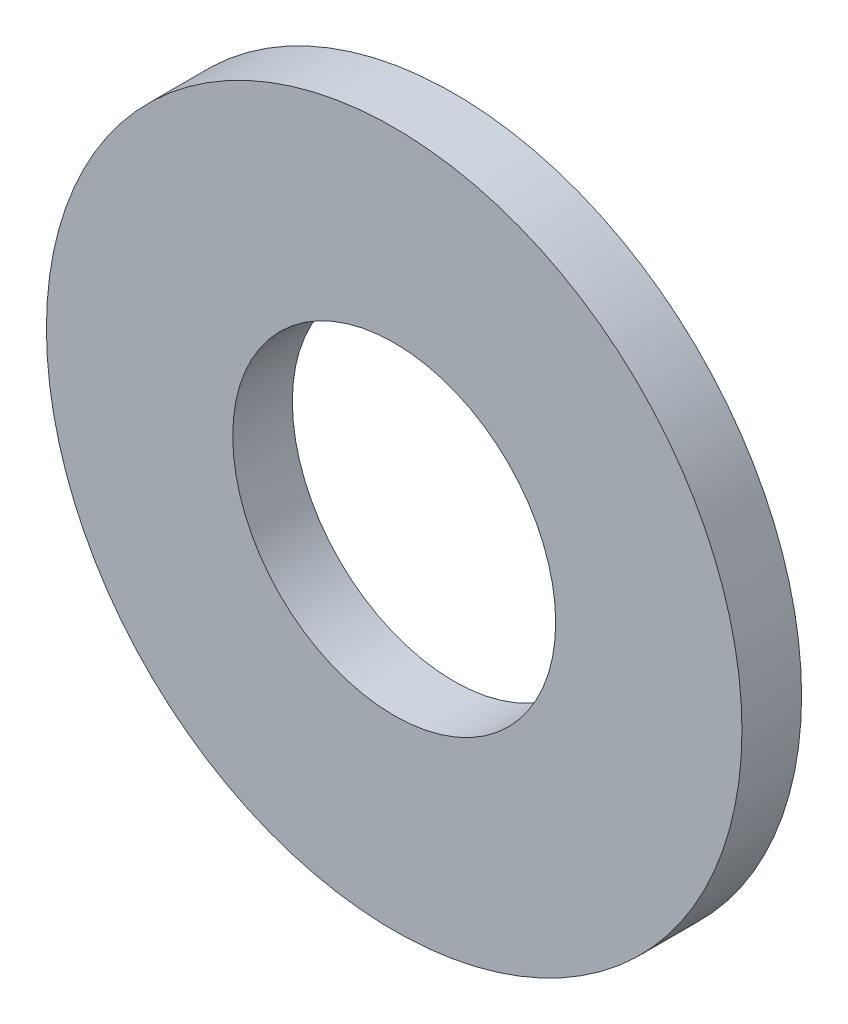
from build123d import *

# Parameters (mm, degrees)
ESQUISSE1_R      = 7
ESQUISSE1_R_2    = 3.25
EXTRUSION1_DEPTH = 0.6


with BuildPart() as part:
    # Esquisse1 → Extrusion1 (new, symmetric)
    with BuildSketch(Plane.XY):
        Circle(ESQUISSE1_R)
        Circle(ESQUISSE1_R_2, mode=Mode.SUBTRACT)
    extrude(amount=EXTRUSION1_DEPTH, both=True)


solid = part.part
